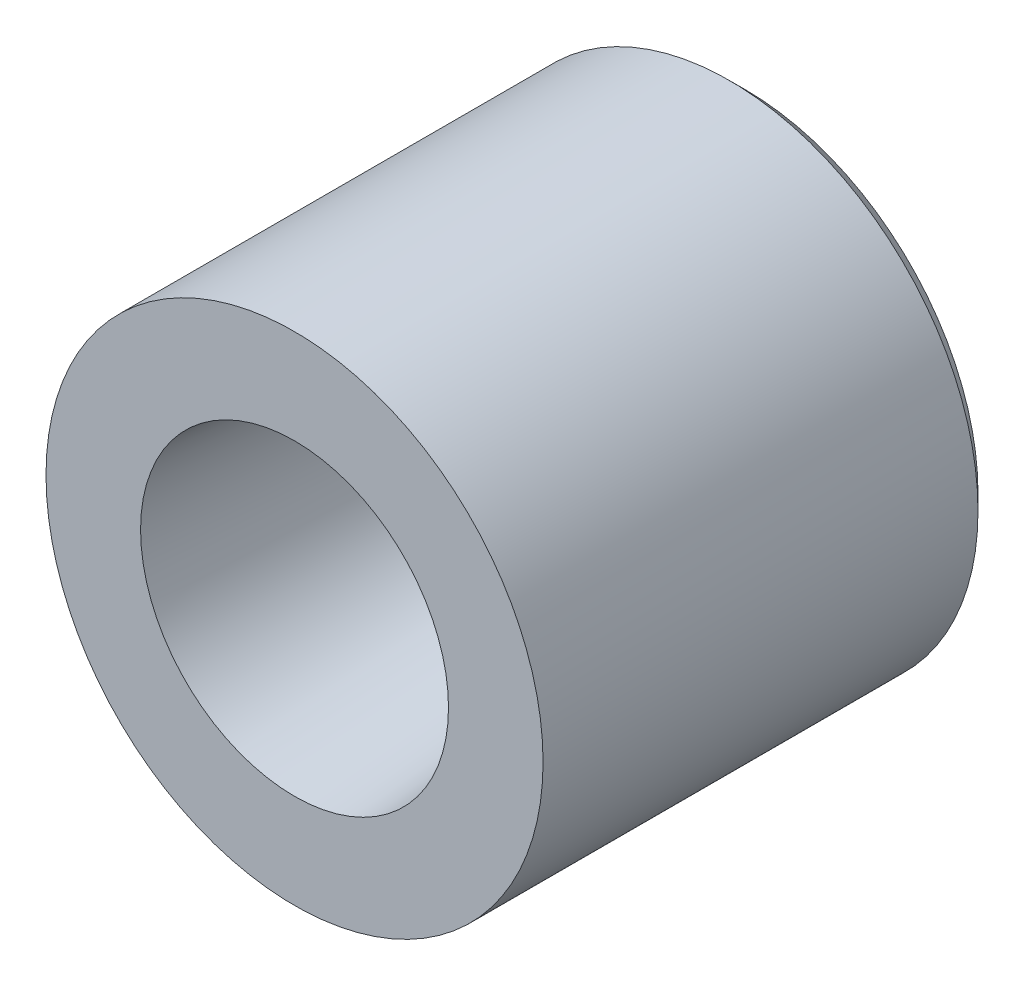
ISO-10303-21;
HEADER;
FILE_DESCRIPTION(('STEP AP214'),'2;1');
FILE_NAME('part.step','',(''),(''),'','','');
FILE_SCHEMA(('AUTOMOTIVE_DESIGN { 1 0 10303 214 1 1 1 1 }'));
ENDSEC;
DATA;
#1=APPLICATION_CONTEXT('core data for automotive mechanical design processes');
#2=APPLICATION_PROTOCOL_DEFINITION('international standard','automotive_design',2000,#1);
#3=PRODUCT_CONTEXT('',#1,'mechanical');
#4=PRODUCT('Part','Part','',(#3));
#5=PRODUCT_RELATED_PRODUCT_CATEGORY('part','',(#4));
#6=PRODUCT_DEFINITION_FORMATION('','',#4);
#7=PRODUCT_DEFINITION_CONTEXT('part definition',#1,'design');
#8=PRODUCT_DEFINITION('design','',#6,#7);
#9=PRODUCT_DEFINITION_SHAPE('','',#8);
#10=(LENGTH_UNIT() NAMED_UNIT(*) SI_UNIT(.MILLI.,.METRE.));
#11=(NAMED_UNIT(*) PLANE_ANGLE_UNIT() SI_UNIT($,.RADIAN.));
#12=(NAMED_UNIT(*) SI_UNIT($,.STERADIAN.) SOLID_ANGLE_UNIT());
#13=UNCERTAINTY_MEASURE_WITH_UNIT(LENGTH_MEASURE(1.E-05),#10,'distance_accuracy_value','');
#14=(GEOMETRIC_REPRESENTATION_CONTEXT(3) GLOBAL_UNCERTAINTY_ASSIGNED_CONTEXT((#13)) GLOBAL_UNIT_ASSIGNED_CONTEXT((#10,
#11,#12)) REPRESENTATION_CONTEXT('',''));
#15=CARTESIAN_POINT('',(0.,0.,0.));
#16=DIRECTION('',(0.,0.,1.));
#17=DIRECTION('',(1.,0.,0.));
#18=AXIS2_PLACEMENT_3D('',#15,#16,#17);
#19=CARTESIAN_POINT('',(0.,0.,-13.4014492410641));
#20=DIRECTION('',(0.,0.,1.));
#21=DIRECTION('',(1.,0.,0.));
#22=AXIS2_PLACEMENT_3D('',#19,#20,#21);
#23=CONICAL_SURFACE('',#22,12.2862208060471,0.785398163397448);
#24=CARTESIAN_POINT('',(-1.25693328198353E-13,0.,-18.));
#25=DIRECTION('',(0.,0.,1.));
#26=DIRECTION('',(-1.,0.,0.));
#27=AXIS2_PLACEMENT_3D('',#24,#25,#26);
#28=CIRCLE('',#27,7.68767004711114);
#29=CARTESIAN_POINT('',(7.68767004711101,0.,-18.));
#30=VERTEX_POINT('',#29);
#31=CARTESIAN_POINT('',(-7.68767004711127,0.,-18.));
#32=VERTEX_POINT('',#31);
#33=EDGE_CURVE('E148',#30,#32,#28,.T.);
#34=ORIENTED_EDGE('',*,*,#33,.F.);
#35=CARTESIAN_POINT('',(7.68766876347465,0.,-18.0000012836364));
#36=CARTESIAN_POINT('',(8.6876698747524,0.,-17.0000001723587));
#37=B_SPLINE_CURVE_WITH_KNOTS('',1,(#35,#36),.UNSPECIFIED.,.F.,.F.,(2,2),(0.625714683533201,
0.707106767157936),.UNSPECIFIED.);
#38=CARTESIAN_POINT('',(8.68767004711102,0.,-17.));
#39=VERTEX_POINT('',#38);
#40=EDGE_CURVE('E48',#30,#39,#37,.T.);
#41=ORIENTED_EDGE('',*,*,#40,.T.);
#42=CARTESIAN_POINT('',(-1.18710365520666E-13,0.,-17.));
#43=DIRECTION('',(0.,0.,-1.));
#44=DIRECTION('',(-1.,0.,0.));
#45=AXIS2_PLACEMENT_3D('',#42,#43,#44);
#46=CIRCLE('',#45,8.68767004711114);
#47=CARTESIAN_POINT('',(-8.68767004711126,0.,-17.));
#48=VERTEX_POINT('',#47);
#49=EDGE_CURVE('E11',#48,#39,#46,.T.);
#50=ORIENTED_EDGE('',*,*,#49,.F.);
#51=CARTESIAN_POINT('',(-1.18710365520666E-13,0.,-17.));
#52=DIRECTION('',(0.,0.,-1.));
#53=DIRECTION('',(-1.,0.,0.));
#54=AXIS2_PLACEMENT_3D('',#51,#52,#53);
#55=CIRCLE('',#54,8.68767004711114);
#56=EDGE_CURVE('E55',#39,#48,#55,.T.);
#57=ORIENTED_EDGE('',*,*,#56,.F.);
#58=ORIENTED_EDGE('',*,*,#40,.F.);
#59=CARTESIAN_POINT('',(-1.25693328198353E-13,0.,-18.));
#60=DIRECTION('',(0.,0.,1.));
#61=DIRECTION('',(-1.,0.,0.));
#62=AXIS2_PLACEMENT_3D('',#59,#60,#61);
#63=CIRCLE('',#62,7.68767004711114);
#64=EDGE_CURVE('E63',#32,#30,#63,.T.);
#65=ORIENTED_EDGE('',*,*,#64,.F.);
#66=EDGE_LOOP('',(#34,#41,#50,#57,#58,#65));
#67=FACE_BOUND('',#66,.T.);
#68=ADVANCED_FACE('F40',(#67),#23,.F.);
#69=CARTESIAN_POINT('',(-1.15218884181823E-13,0.,-16.5));
#70=DIRECTION('',(0.,0.,-1.));
#71=DIRECTION('',(-1.,0.,0.));
#72=AXIS2_PLACEMENT_3D('',#69,#70,#71);
#73=CYLINDRICAL_SURFACE('',#72,8.68767004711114);
#74=CARTESIAN_POINT('',(-1.04744440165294E-13,0.,-15.));
#75=DIRECTION('',(0.,0.,-1.));
#76=DIRECTION('',(-1.,0.,0.));
#77=AXIS2_PLACEMENT_3D('',#74,#75,#76);
#78=CIRCLE('',#77,8.68767004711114);
#79=CARTESIAN_POINT('',(-8.68767004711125,0.,-15.));
#80=VERTEX_POINT('',#79);
#81=EDGE_CURVE('E157',#80,#80,#78,.T.);
#82=ORIENTED_EDGE('',*,*,#81,.F.);
#83=CARTESIAN_POINT('',(-8.68767004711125,0.,-14.9999969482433));
#84=CARTESIAN_POINT('',(-8.68767004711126,0.,-17.0000020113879));
#85=B_SPLINE_CURVE_WITH_KNOTS('',1,(#83,#84),.UNSPECIFIED.,.F.,.F.,(2,2),(0.0833320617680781,
0.91666750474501),.UNSPECIFIED.);
#86=EDGE_CURVE('E152',#80,#48,#85,.T.);
#87=ORIENTED_EDGE('',*,*,#86,.T.);
#88=ORIENTED_EDGE('',*,*,#49,.T.);
#89=ORIENTED_EDGE('',*,*,#56,.T.);
#90=ORIENTED_EDGE('',*,*,#86,.F.);
#91=EDGE_LOOP('',(#82,#87,#88,#89,#90));
#92=FACE_BOUND('',#91,.T.);
#93=ADVANCED_FACE('F199',(#92),#73,.F.);
#94=CARTESIAN_POINT('',(17.6816411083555,-15.9785221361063,-18.));
#95=DIRECTION('',(0.,0.,-1.));
#96=DIRECTION('',(-1.,0.,0.));
#97=AXIS2_PLACEMENT_3D('',#94,#95,#96);
#98=PLANE('',#97);
#99=CARTESIAN_POINT('',(-2.09488880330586E-13,0.,-17.9999999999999));
#100=DIRECTION('',(0.,0.,-1.));
#101=DIRECTION('',(-1.,0.,0.));
#102=AXIS2_PLACEMENT_3D('',#99,#100,#101);
#103=CIRCLE('',#102,4.24999999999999);
#104=CARTESIAN_POINT('',(-4.2500000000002,0.,-17.9999999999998));
#105=VERTEX_POINT('',#104);
#106=EDGE_CURVE('E43',#105,#105,#103,.T.);
#107=ORIENTED_EDGE('',*,*,#106,.T.);
#108=EDGE_LOOP('',(#107));
#109=FACE_BOUND('',#108,.T.);
#110=ORIENTED_EDGE('',*,*,#64,.T.);
#111=ORIENTED_EDGE('',*,*,#33,.T.);
#112=EDGE_LOOP('',(#110,#111));
#113=FACE_BOUND('',#112,.T.);
#114=ADVANCED_FACE('F201',(#109,#113),#98,.F.);
#115=CARTESIAN_POINT('',(0.,0.,-1.));
#116=DIRECTION('',(0.,0.,1.));
#117=DIRECTION('',(-1.,0.,0.));
#118=AXIS2_PLACEMENT_3D('',#115,#116,#117);
#119=CONICAL_SURFACE('',#118,9.91251133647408,0.0872664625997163);
#120=ORIENTED_EDGE('',*,*,#81,.T.);
#121=CARTESIAN_POINT('',(-8.68767004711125,0.,-15.));
#122=CARTESIAN_POINT('',(-9.91251133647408,0.,-0.999999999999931));
#123=B_SPLINE_CURVE_WITH_KNOTS('',1,(#121,#122),.UNSPECIFIED.,.F.,.F.,(2,2),(0.,1.),.UNSPECIFIED.);
#124=CARTESIAN_POINT('',(-9.91251133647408,0.,-0.999999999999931));
#125=VERTEX_POINT('',#124);
#126=EDGE_CURVE('E113',#80,#125,#123,.T.);
#127=ORIENTED_EDGE('',*,*,#126,.T.);
#128=CARTESIAN_POINT('',(0.,0.,-1.));
#129=DIRECTION('',(0.,0.,-1.));
#130=DIRECTION('',(1.,0.,0.));
#131=AXIS2_PLACEMENT_3D('',#128,#129,#130);
#132=CIRCLE('',#131,9.91251133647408);
#133=CARTESIAN_POINT('',(9.91251133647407,0.,-1.00000000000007));
#134=VERTEX_POINT('',#133);
#135=EDGE_CURVE('E138',#134,#125,#132,.T.);
#136=ORIENTED_EDGE('',*,*,#135,.F.);
#137=CARTESIAN_POINT('',(0.,0.,-1.));
#138=DIRECTION('',(0.,0.,-1.));
#139=DIRECTION('',(1.,0.,0.));
#140=AXIS2_PLACEMENT_3D('',#137,#138,#139);
#141=CIRCLE('',#140,9.91251133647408);
#142=EDGE_CURVE('E131',#125,#134,#141,.T.);
#143=ORIENTED_EDGE('',*,*,#142,.F.);
#144=ORIENTED_EDGE('',*,*,#126,.F.);
#145=EDGE_LOOP('',(#120,#127,#136,#143,#144));
#146=FACE_BOUND('',#145,.T.);
#147=ADVANCED_FACE('F197',(#146),#119,.F.);
#148=CARTESIAN_POINT('',(-1.56226912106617E-13,0.,-22.3725830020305));
#149=DIRECTION('',(0.,0.,1.));
#150=DIRECTION('',(1.,0.,0.));
#151=AXIS2_PLACEMENT_3D('',#148,#149,#150);
#152=CONICAL_SURFACE('',#151,22.6274169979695,0.785398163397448);
#153=CARTESIAN_POINT('',(-2.09488880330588E-13,0.,-30.));
#154=DIRECTION('',(0.,0.,1.));
#155=DIRECTION('',(-1.,0.,0.));
#156=AXIS2_PLACEMENT_3D('',#153,#154,#155);
#157=CIRCLE('',#156,15.);
#158=CARTESIAN_POINT('',(-15.,0.,-30.));
#159=VERTEX_POINT('',#158);
#160=CARTESIAN_POINT('',(14.9999999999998,0.,-30.));
#161=VERTEX_POINT('',#160);
#162=EDGE_CURVE('E94',#159,#161,#157,.T.);
#163=ORIENTED_EDGE('',*,*,#162,.T.);
#164=CARTESIAN_POINT('',(15.0000010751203,0.,-29.9999989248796));
#165=CARTESIAN_POINT('',(16.0000024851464,0.,-28.9999975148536));
#166=B_SPLINE_CURVE_WITH_KNOTS('',1,(#164,#165),.UNSPECIFIED.,.F.,.F.,(2,2),(0.662912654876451,
0.707106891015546),.UNSPECIFIED.);
#167=CARTESIAN_POINT('',(16.,0.,-29.));
#168=VERTEX_POINT('',#167);
#169=EDGE_CURVE('E99',#161,#168,#166,.T.);
#170=ORIENTED_EDGE('',*,*,#169,.T.);
#171=CARTESIAN_POINT('',(-2.02505917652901E-13,0.,-29.));
#172=DIRECTION('',(0.,0.,-1.));
#173=DIRECTION('',(-1.,0.,0.));
#174=AXIS2_PLACEMENT_3D('',#171,#172,#173);
#175=CIRCLE('',#174,16.);
#176=CARTESIAN_POINT('',(-16.,0.,-29.));
#177=VERTEX_POINT('',#176);
#178=EDGE_CURVE('E107',#168,#177,#175,.T.);
#179=ORIENTED_EDGE('',*,*,#178,.T.);
#180=CARTESIAN_POINT('',(-2.02505917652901E-13,0.,-29.));
#181=DIRECTION('',(0.,0.,-1.));
#182=DIRECTION('',(-1.,0.,0.));
#183=AXIS2_PLACEMENT_3D('',#180,#181,#182);
#184=CIRCLE('',#183,16.);
#185=EDGE_CURVE('E109',#177,#168,#184,.T.);
#186=ORIENTED_EDGE('',*,*,#185,.T.);
#187=ORIENTED_EDGE('',*,*,#169,.F.);
#188=CARTESIAN_POINT('',(-2.09488880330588E-13,0.,-30.));
#189=DIRECTION('',(0.,0.,1.));
#190=DIRECTION('',(-1.,0.,0.));
#191=AXIS2_PLACEMENT_3D('',#188,#189,#190);
#192=CIRCLE('',#191,15.);
#193=EDGE_CURVE('E101',#161,#159,#192,.T.);
#194=ORIENTED_EDGE('',*,*,#193,.T.);
#195=EDGE_LOOP('',(#163,#170,#179,#186,#187,#194));
#196=FACE_BOUND('',#195,.T.);
#197=ADVANCED_FACE('F96',(#196),#152,.T.);
#198=CARTESIAN_POINT('',(-1.08235921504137E-13,0.,-15.5));
#199=DIRECTION('',(0.,0.,-1.));
#200=DIRECTION('',(-1.,0.,0.));
#201=AXIS2_PLACEMENT_3D('',#198,#199,#200);
#202=CYLINDRICAL_SURFACE('',#201,16.);
#203=CARTESIAN_POINT('',(0.,0.,-1.));
#204=DIRECTION('',(0.,0.,1.));
#205=DIRECTION('',(-1.,0.,0.));
#206=AXIS2_PLACEMENT_3D('',#203,#204,#205);
#207=CIRCLE('',#206,16.);
#208=CARTESIAN_POINT('',(-16.,0.,-0.999999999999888));
#209=VERTEX_POINT('',#208);
#210=EDGE_CURVE('E103',#209,#209,#207,.T.);
#211=ORIENTED_EDGE('',*,*,#210,.F.);
#212=CARTESIAN_POINT('',(-16.,0.,-0.999998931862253));
#213=CARTESIAN_POINT('',(-16.,0.,-28.9999996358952));
#214=B_SPLINE_CURVE_WITH_KNOTS('',1,(#212,#213),.UNSPECIFIED.,.F.,.F.,(2,2),(0.0833333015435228,
0.916666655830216),.UNSPECIFIED.);
#215=EDGE_CURVE('E178',#209,#177,#214,.T.);
#216=ORIENTED_EDGE('',*,*,#215,.T.);
#217=ORIENTED_EDGE('',*,*,#178,.F.);
#218=ORIENTED_EDGE('',*,*,#185,.F.);
#219=ORIENTED_EDGE('',*,*,#215,.F.);
#220=EDGE_LOOP('',(#211,#216,#217,#218,#219));
#221=FACE_BOUND('',#220,.T.);
#222=ADVANCED_FACE('F234',(#221),#202,.T.);
#223=CARTESIAN_POINT('',(34.5,-31.1769145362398,-30.));
#224=DIRECTION('',(0.,0.,-1.));
#225=DIRECTION('',(-1.,0.,0.));
#226=AXIS2_PLACEMENT_3D('',#223,#224,#225);
#227=PLANE('',#226);
#228=CARTESIAN_POINT('',(-2.09488880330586E-13,0.,-29.9999999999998));
#229=DIRECTION('',(0.,0.,-1.));
#230=DIRECTION('',(-1.,0.,0.));
#231=AXIS2_PLACEMENT_3D('',#228,#229,#230);
#232=CIRCLE('',#231,4.24999999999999);
#233=CARTESIAN_POINT('',(-4.2500000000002,0.,-29.9999999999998));
#234=VERTEX_POINT('',#233);
#235=EDGE_CURVE('E291',#234,#234,#232,.T.);
#236=ORIENTED_EDGE('',*,*,#235,.F.);
#237=EDGE_LOOP('',(#236));
#238=FACE_BOUND('',#237,.T.);
#239=ORIENTED_EDGE('',*,*,#193,.F.);
#240=ORIENTED_EDGE('',*,*,#162,.F.);
#241=EDGE_LOOP('',(#239,#240));
#242=FACE_BOUND('',#241,.T.);
#243=ADVANCED_FACE('F105',(#238,#242),#227,.T.);
#244=CARTESIAN_POINT('',(-20.8,-33.2553755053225,-0.999999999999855));
#245=DIRECTION('',(0.,0.,1.));
#246=DIRECTION('',(1.,0.,0.));
#247=AXIS2_PLACEMENT_3D('',#244,#245,#246);
#248=PLANE('',#247);
#249=ORIENTED_EDGE('',*,*,#210,.T.);
#250=EDGE_LOOP('',(#249));
#251=FACE_BOUND('',#250,.T.);
#252=ORIENTED_EDGE('',*,*,#135,.T.);
#253=ORIENTED_EDGE('',*,*,#142,.T.);
#254=EDGE_LOOP('',(#252,#253));
#255=FACE_BOUND('',#254,.T.);
#256=ADVANCED_FACE('F241',(#251,#255),#248,.T.);
#257=CARTESIAN_POINT('',(-2.09488880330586E-13,0.,-29.9999999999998));
#258=DIRECTION('',(0.,0.,-1.));
#259=DIRECTION('',(-1.,0.,0.));
#260=AXIS2_PLACEMENT_3D('',#257,#258,#259);
#261=CYLINDRICAL_SURFACE('',#260,4.24999999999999);
#262=ORIENTED_EDGE('',*,*,#235,.T.);
#263=EDGE_LOOP('',(#262));
#264=FACE_BOUND('',#263,.T.);
#265=ORIENTED_EDGE('',*,*,#106,.F.);
#266=EDGE_LOOP('',(#265));
#267=FACE_BOUND('',#266,.T.);
#268=ADVANCED_FACE('F237',(#264,#267),#261,.F.);
#269=CLOSED_SHELL('',(#68,#93,#114,#147,#197,#222,#243,#256,#268));
#270=MANIFOLD_SOLID_BREP('B2',#269);
#271=ADVANCED_BREP_SHAPE_REPRESENTATION('',(#18,#270),#14);
#272=SHAPE_DEFINITION_REPRESENTATION(#9,#271);
ENDSEC;
END-ISO-10303-21;
